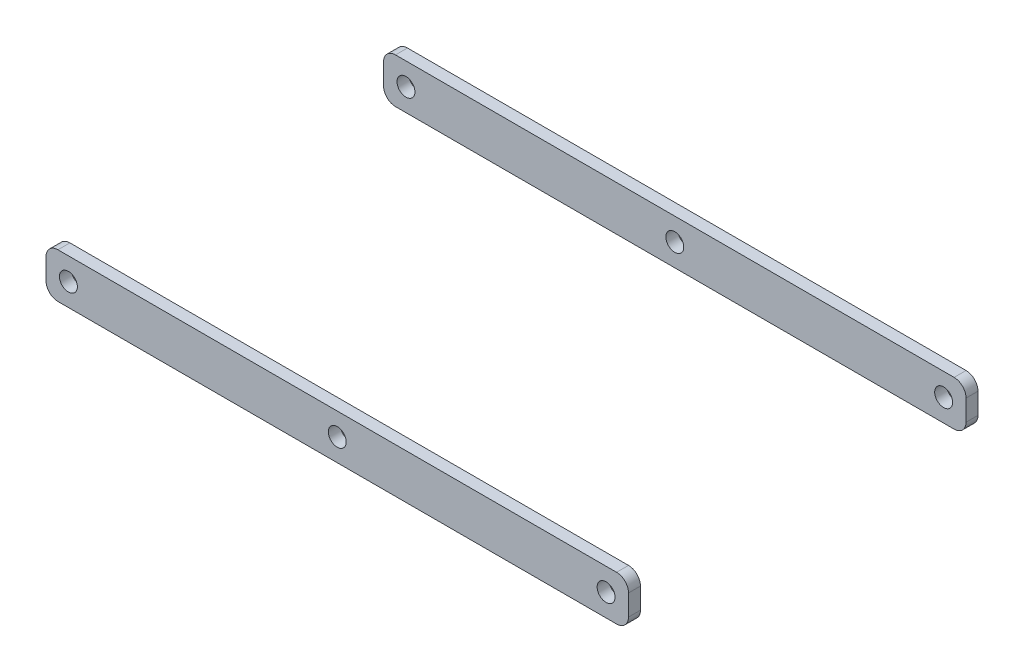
from build123d import *

# Parameters (mm, degrees)
SKETCH_1_W                           = 390
SKETCH_1_H                           = 30
ARMBLANK_390X30_DEPTH                = 117
SKETCH_2_W                           = 400
SKETCH_2_H                           = 40
SEPARATE_LEFT_RIGHT_8MM_ARMS_DEPTH   = 109
SKETCH_3_R                           = 6
THREE_PIVOT_HOLES_D12_PITCH180_DEPTH = 500
ARM_END_CORNER_R8_R                  = 8
ARM_END_CORNER_R8_BODY1_R            = 8


with BuildPart() as part:
    # Sketch 1 → ArmBlank_390x30 (new, symmetric)
    with BuildSketch(Plane.XY):
        Rectangle(SKETCH_1_W, SKETCH_1_H)
    extrude(amount=ARMBLANK_390X30_DEPTH, both=True)

    # Sketch 2 → Separate_Left_Right_8mm_Arms (cut, symmetric)
    with BuildSketch(Plane.XY):
        Rectangle(SKETCH_2_W, SKETCH_2_H)
    extrude(amount=SEPARATE_LEFT_RIGHT_8MM_ARMS_DEPTH, both=True, mode=Mode.SUBTRACT)


with BuildPart() as separate_left_right_8mm_arms_piece_1:
    # of the separate pieces the step leaves, piece 1, a body of its own (separate_left_right_8mm_arms_pieces)
    add(part.part.solids().sort_by_distance((-195, -15, -109))[0])


with BuildPart() as separate_left_right_8mm_arms_piece_2:
    # of the separate pieces the step leaves, piece 2, a body of its own (separate_left_right_8mm_arms_pieces)
    add(part.part.solids().sort_by_distance((-195, -15, 117))[0])


with BuildPart() as three_pivot_holes_d12_pitch180_tool:
    # Sketch 3 → Three_Pivot_Holes_D12_Pitch180 (new, symmetric)
    with BuildSketch(Plane.XY):
        with Locations(Location((-180, 0, 0), (0, 0, 180))):
            Circle(SKETCH_3_R)
        with Locations(Location((0, 0, 0), (0, 0, 180))):
            Circle(SKETCH_3_R)
        with Locations(Location((180, 0, 0), (0, 0, 180))):
            Circle(SKETCH_3_R)
    extrude(amount=THREE_PIVOT_HOLES_D12_PITCH180_DEPTH, both=True)


with BuildPart() as separate_left_right_8mm_arms_piece_1_1:
    add(separate_left_right_8mm_arms_piece_1.part)

    # Three_Pivot_Holes_D12_Pitch180: cut by three_pivot_holes_d12_pitch180_tool
    add(three_pivot_holes_d12_pitch180_tool.part, mode=Mode.SUBTRACT)

    # Arm_End_Corner_R8
    arm_end_corner_r8_edges = [separate_left_right_8mm_arms_piece_1_1.edges().sort_by_distance(p)[0] for p in [
        (195, 15, -113),
        (195, -15, -113),
        (-195, -15, -113),
        (-195, 15, -113),
    ]]
    fillet(arm_end_corner_r8_edges, radius=ARM_END_CORNER_R8_R)


with BuildPart() as separate_left_right_8mm_arms_piece_2_1:
    add(separate_left_right_8mm_arms_piece_2.part)

    # Three_Pivot_Holes_D12_Pitch180: cut by three_pivot_holes_d12_pitch180_tool
    add(three_pivot_holes_d12_pitch180_tool.part, mode=Mode.SUBTRACT)

    # Arm_End_Corner_R8_Body1
    arm_end_corner_r8_body1_edges = [separate_left_right_8mm_arms_piece_2_1.edges().sort_by_distance(p)[0] for p in [
        (195, 15, 113),
        (-195, 15, 113),
        (-195, -15, 113),
        (195, -15, 113),
    ]]
    fillet(arm_end_corner_r8_body1_edges, radius=ARM_END_CORNER_R8_BODY1_R)


solid = Compound([separate_left_right_8mm_arms_piece_1_1.part, separate_left_right_8mm_arms_piece_2_1.part])
